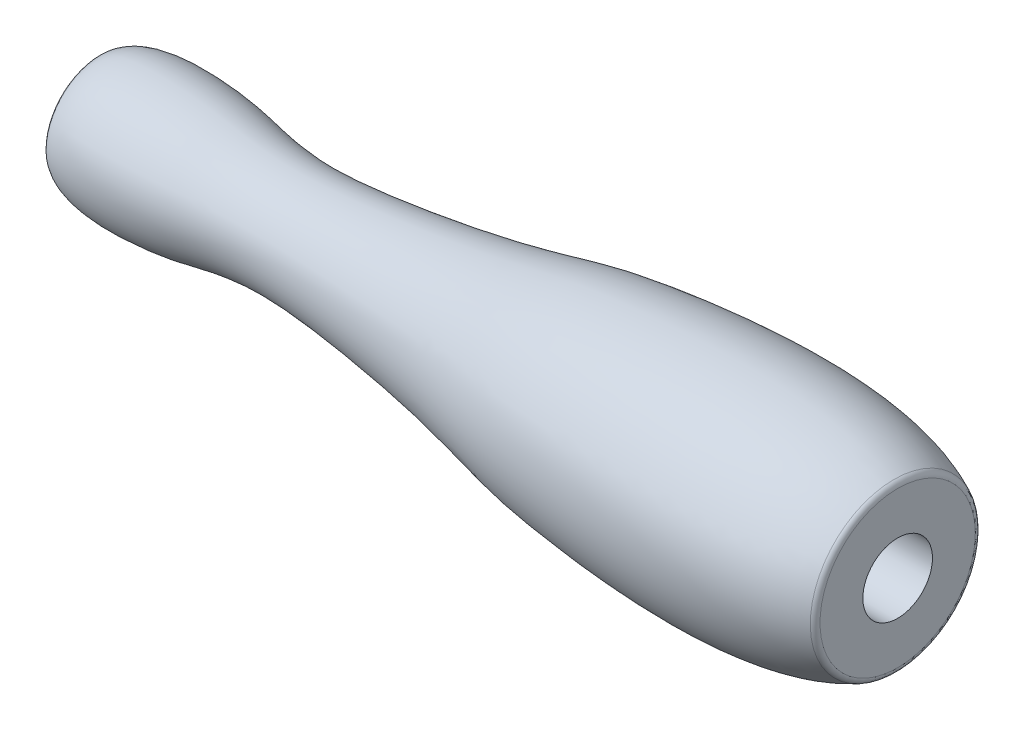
from build123d import *

# Parameters (mm, degrees)
SKETCH3_R               = 5.25
CUT_EXTRUDE1_DEPTH      = 128.121070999
CUT_EXTRUDE2_DEPTH      = 20
CUT_EXTRUDE2_DEPTH_BACK = 20
SKETCH4_W               = 11.904820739
SKETCH4_H               = 45.862833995
FILLET1_R               = 1


with BuildPart() as part:
    # Sketch2 → Revolve1 (revolve)
    with BuildSketch(Plane.XY):
        with BuildLine():
            Line((0, 0), (-125, 0))
            Line((-125, 0), (-125, 8))
            add(Edge.make_bspline(
                [(-125, 8), (-122.149725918, 10.710693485), (-110.815290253, 9.987494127), (-99.502342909, 7.684323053), (-92.50669396, 7.287588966), (-66.58391934, 10.838179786), (-55.724485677, 13.999026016), (-24.965215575, 17.806584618), (-6.957255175, 16.246803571), (0, 9)],
                knots=[0, 0, 0, 0, 0.100134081, 0.122525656, 0.271871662, 0.364442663, 0.474962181, 0.538517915, 1, 1, 1, 1], degree=3))
            Line((0, 9), (0, 0))
        make_face()
    revolve(axis=Axis((0, 0, 0), (-1, 0, 0)))

    # Sketch3 → Cut-Extrude1 (cut, through all)
    with BuildSketch(Plane(origin=(0, 0, 0), x_dir=(0, 0, -1), z_dir=(1, 0, 0))):
        with Locations(Location((0, 0, 0), (0, 0, 90))):
            Circle(SKETCH3_R)
    extrude(amount=-CUT_EXTRUDE1_DEPTH, mode=Mode.SUBTRACT)

    # Sketch4 → Cut-Extrude2 (cut, two sides: drawn at the far end of the back side and taken through both)
    with BuildSketch(Plane(origin=(0, 0, 0), x_dir=(1, 0, 0), z_dir=(0, 1, 0)).offset(-CUT_EXTRUDE2_DEPTH_BACK)):
        with Locations((1.4152261, 2.146770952)):
            Rectangle(SKETCH4_W, SKETCH4_H)
    extrude(amount=CUT_EXTRUDE2_DEPTH + CUT_EXTRUDE2_DEPTH_BACK, mode=Mode.SUBTRACT)

    # Fillet1
    fillet1_edges = [part.edges().sort_by_distance(p)[0] for p in [
        (-4.53718427, -12.322143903, -1e-09),
        (-125, -8, 0),
    ]]
    fillet(fillet1_edges, radius=FILLET1_R)


solid = part.part
